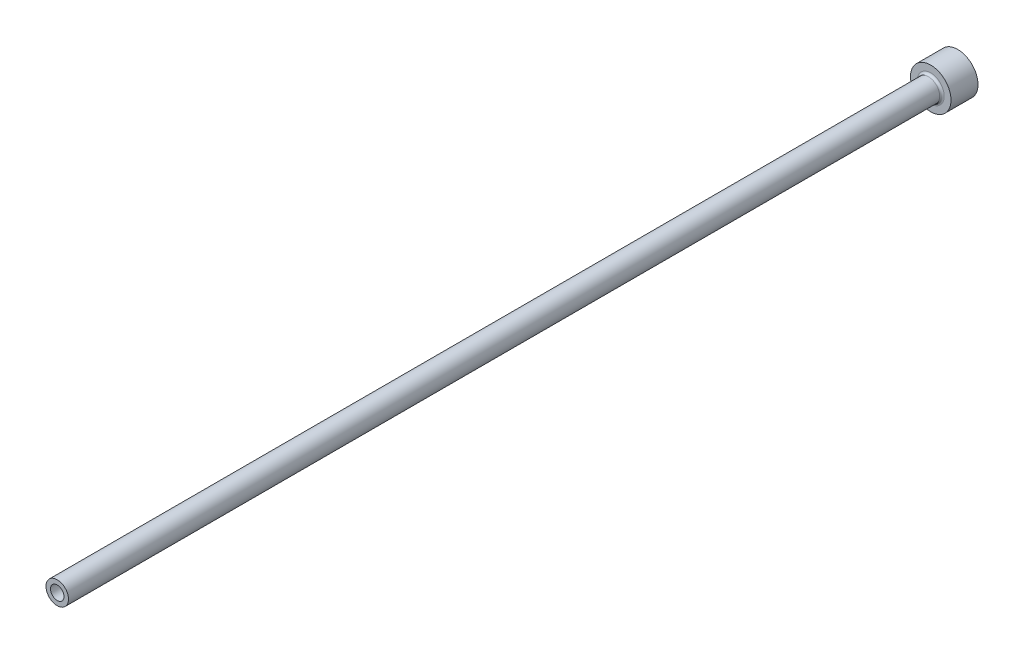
ISO-10303-21;
HEADER;
FILE_DESCRIPTION(('STEP AP214'),'2;1');
FILE_NAME('part.step','',(''),(''),'','','');
FILE_SCHEMA(('AUTOMOTIVE_DESIGN { 1 0 10303 214 1 1 1 1 }'));
ENDSEC;
DATA;
#1=APPLICATION_CONTEXT('core data for automotive mechanical design processes');
#2=APPLICATION_PROTOCOL_DEFINITION('international standard','automotive_design',2000,#1);
#3=PRODUCT_CONTEXT('',#1,'mechanical');
#4=PRODUCT('Part','Part','',(#3));
#5=PRODUCT_RELATED_PRODUCT_CATEGORY('part','',(#4));
#6=PRODUCT_DEFINITION_FORMATION('','',#4);
#7=PRODUCT_DEFINITION_CONTEXT('part definition',#1,'design');
#8=PRODUCT_DEFINITION('design','',#6,#7);
#9=PRODUCT_DEFINITION_SHAPE('','',#8);
#10=(LENGTH_UNIT() NAMED_UNIT(*) SI_UNIT(.MILLI.,.METRE.));
#11=(NAMED_UNIT(*) PLANE_ANGLE_UNIT() SI_UNIT($,.RADIAN.));
#12=(NAMED_UNIT(*) SI_UNIT($,.STERADIAN.) SOLID_ANGLE_UNIT());
#13=UNCERTAINTY_MEASURE_WITH_UNIT(LENGTH_MEASURE(1.E-05),#10,'distance_accuracy_value','');
#14=(GEOMETRIC_REPRESENTATION_CONTEXT(3) GLOBAL_UNCERTAINTY_ASSIGNED_CONTEXT((#13)) GLOBAL_UNIT_ASSIGNED_CONTEXT((#10,
#11,#12)) REPRESENTATION_CONTEXT('',''));
#15=CARTESIAN_POINT('',(0.,0.,0.));
#16=DIRECTION('',(0.,0.,1.));
#17=DIRECTION('',(1.,0.,0.));
#18=AXIS2_PLACEMENT_3D('',#15,#16,#17);
#19=CARTESIAN_POINT('',(0.,0.,200.));
#20=DIRECTION('',(0.,0.,-1.));
#21=DIRECTION('',(-1.,0.,0.));
#22=AXIS2_PLACEMENT_3D('',#19,#20,#21);
#23=PLANE('',#22);
#24=CARTESIAN_POINT('',(0.,0.,200.));
#25=DIRECTION('',(0.,0.,1.));
#26=DIRECTION('',(1.,0.,0.));
#27=AXIS2_PLACEMENT_3D('',#24,#25,#26);
#28=CIRCLE('',#27,1.49999999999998);
#29=CARTESIAN_POINT('',(1.49999999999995,0.,200.));
#30=VERTEX_POINT('',#29);
#31=EDGE_CURVE('E63',#30,#30,#28,.T.);
#32=ORIENTED_EDGE('',*,*,#31,.F.);
#33=EDGE_LOOP('',(#32));
#34=FACE_BOUND('',#33,.T.);
#35=CARTESIAN_POINT('',(0.,0.,200.));
#36=DIRECTION('',(0.,0.,1.));
#37=DIRECTION('',(1.,0.,0.));
#38=AXIS2_PLACEMENT_3D('',#35,#36,#37);
#39=CIRCLE('',#38,2.49999999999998);
#40=CARTESIAN_POINT('',(2.49999999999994,0.,200.));
#41=VERTEX_POINT('',#40);
#42=EDGE_CURVE('E54',#41,#41,#39,.T.);
#43=ORIENTED_EDGE('',*,*,#42,.T.);
#44=EDGE_LOOP('',(#43));
#45=FACE_BOUND('',#44,.T.);
#46=ADVANCED_FACE('F34',(#34,#45),#23,.F.);
#47=CARTESIAN_POINT('',(0.,0.,200.));
#48=DIRECTION('',(0.,0.,1.));
#49=DIRECTION('',(1.,0.,0.));
#50=AXIS2_PLACEMENT_3D('',#47,#48,#49);
#51=CYLINDRICAL_SURFACE('',#50,2.49999999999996);
#52=CARTESIAN_POINT('',(0.,0.,6.50000000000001));
#53=DIRECTION('',(0.,0.,1.));
#54=DIRECTION('',(1.,0.,0.));
#55=AXIS2_PLACEMENT_3D('',#52,#53,#54);
#56=CIRCLE('',#55,2.49999999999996);
#57=CARTESIAN_POINT('',(2.49999999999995,0.,6.50000000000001));
#58=VERTEX_POINT('',#57);
#59=EDGE_CURVE('E49',#58,#58,#56,.T.);
#60=ORIENTED_EDGE('',*,*,#59,.T.);
#61=EDGE_LOOP('',(#60));
#62=FACE_BOUND('',#61,.T.);
#63=ORIENTED_EDGE('',*,*,#42,.F.);
#64=EDGE_LOOP('',(#63));
#65=FACE_BOUND('',#64,.T.);
#66=ADVANCED_FACE('F92',(#62,#65),#51,.T.);
#67=CARTESIAN_POINT('',(0.,0.,6.));
#68=DIRECTION('',(0.,0.,1.));
#69=DIRECTION('',(1.,0.,0.));
#70=AXIS2_PLACEMENT_3D('',#67,#68,#69);
#71=PLANE('',#70);
#72=CARTESIAN_POINT('',(0.,0.,6.));
#73=DIRECTION('',(0.,0.,1.));
#74=DIRECTION('',(1.,0.,0.));
#75=AXIS2_PLACEMENT_3D('',#72,#73,#74);
#76=CIRCLE('',#75,2.99999999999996);
#77=CARTESIAN_POINT('',(2.99999999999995,0.,6.));
#78=VERTEX_POINT('',#77);
#79=EDGE_CURVE('E45',#78,#78,#76,.F.);
#80=ORIENTED_EDGE('',*,*,#79,.T.);
#81=EDGE_LOOP('',(#80));
#82=FACE_BOUND('',#81,.T.);
#83=CARTESIAN_POINT('',(0.,0.,6.00000000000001));
#84=DIRECTION('',(0.,0.,1.));
#85=DIRECTION('',(1.,0.,0.));
#86=AXIS2_PLACEMENT_3D('',#83,#84,#85);
#87=CIRCLE('',#86,4.49999999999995);
#88=CARTESIAN_POINT('',(4.49999999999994,0.,6.00000000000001));
#89=VERTEX_POINT('',#88);
#90=EDGE_CURVE('E57',#89,#89,#87,.T.);
#91=ORIENTED_EDGE('',*,*,#90,.T.);
#92=EDGE_LOOP('',(#91));
#93=FACE_BOUND('',#92,.T.);
#94=ADVANCED_FACE('F98',(#82,#93),#71,.T.);
#95=CARTESIAN_POINT('',(0.,0.,200.));
#96=DIRECTION('',(0.,0.,1.));
#97=DIRECTION('',(1.,0.,0.));
#98=AXIS2_PLACEMENT_3D('',#95,#96,#97);
#99=CYLINDRICAL_SURFACE('',#98,4.49999999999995);
#100=ORIENTED_EDGE('',*,*,#90,.F.);
#101=EDGE_LOOP('',(#100));
#102=FACE_BOUND('',#101,.T.);
#103=CARTESIAN_POINT('',(0.,0.,0.));
#104=DIRECTION('',(0.,0.,1.));
#105=DIRECTION('',(1.,0.,0.));
#106=AXIS2_PLACEMENT_3D('',#103,#104,#105);
#107=CIRCLE('',#106,4.49999999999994);
#108=CARTESIAN_POINT('',(4.49999999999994,0.,0.));
#109=VERTEX_POINT('',#108);
#110=EDGE_CURVE('E60',#109,#109,#107,.T.);
#111=ORIENTED_EDGE('',*,*,#110,.T.);
#112=EDGE_LOOP('',(#111));
#113=FACE_BOUND('',#112,.T.);
#114=ADVANCED_FACE('F89',(#102,#113),#99,.T.);
#115=CARTESIAN_POINT('',(0.,0.,0.));
#116=DIRECTION('',(0.,0.,1.));
#117=DIRECTION('',(1.,0.,0.));
#118=AXIS2_PLACEMENT_3D('',#115,#116,#117);
#119=PLANE('',#118);
#120=CARTESIAN_POINT('',(0.,0.,0.));
#121=DIRECTION('',(0.,0.,1.));
#122=DIRECTION('',(1.,0.,0.));
#123=AXIS2_PLACEMENT_3D('',#120,#121,#122);
#124=CIRCLE('',#123,2.24999999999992);
#125=CARTESIAN_POINT('',(2.24999999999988,0.,0.));
#126=VERTEX_POINT('',#125);
#127=EDGE_CURVE('E41',#126,#126,#124,.T.);
#128=ORIENTED_EDGE('',*,*,#127,.T.);
#129=EDGE_LOOP('',(#128));
#130=FACE_BOUND('',#129,.T.);
#131=ORIENTED_EDGE('',*,*,#110,.F.);
#132=EDGE_LOOP('',(#131));
#133=FACE_BOUND('',#132,.T.);
#134=ADVANCED_FACE('F83',(#130,#133),#119,.F.);
#135=CARTESIAN_POINT('',(0.,0.,200.));
#136=DIRECTION('',(0.,0.,1.));
#137=DIRECTION('',(1.,0.,0.));
#138=AXIS2_PLACEMENT_3D('',#135,#136,#137);
#139=CYLINDRICAL_SURFACE('',#138,1.49999999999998);
#140=ORIENTED_EDGE('',*,*,#31,.T.);
#141=EDGE_LOOP('',(#140));
#142=FACE_BOUND('',#141,.T.);
#143=CARTESIAN_POINT('',(0.,0.,125.));
#144=DIRECTION('',(0.,0.,1.));
#145=DIRECTION('',(1.,0.,0.));
#146=AXIS2_PLACEMENT_3D('',#143,#144,#145);
#147=CIRCLE('',#146,1.49999999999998);
#148=CARTESIAN_POINT('',(1.49999999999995,0.,125.));
#149=VERTEX_POINT('',#148);
#150=EDGE_CURVE('E66',#149,#149,#147,.T.);
#151=ORIENTED_EDGE('',*,*,#150,.F.);
#152=EDGE_LOOP('',(#151));
#153=FACE_BOUND('',#152,.T.);
#154=ADVANCED_FACE('F78',(#142,#153),#139,.F.);
#155=CARTESIAN_POINT('',(0.,0.,125.));
#156=DIRECTION('',(0.,0.,-1.));
#157=DIRECTION('',(-1.,0.,0.));
#158=AXIS2_PLACEMENT_3D('',#155,#156,#157);
#159=CONICAL_SURFACE('',#158,1.49999999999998,0.523598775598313);
#160=CARTESIAN_POINT('',(0.,0.,124.566987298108));
#161=DIRECTION('',(0.,0.,1.));
#162=DIRECTION('',(1.,0.,0.));
#163=AXIS2_PLACEMENT_3D('',#160,#161,#162);
#164=CIRCLE('',#163,1.74999999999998);
#165=CARTESIAN_POINT('',(1.74999999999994,0.,124.566987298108));
#166=VERTEX_POINT('',#165);
#167=EDGE_CURVE('E69',#166,#166,#164,.T.);
#168=ORIENTED_EDGE('',*,*,#167,.F.);
#169=EDGE_LOOP('',(#168));
#170=FACE_BOUND('',#169,.T.);
#171=ORIENTED_EDGE('',*,*,#150,.T.);
#172=EDGE_LOOP('',(#171));
#173=FACE_BOUND('',#172,.T.);
#174=ADVANCED_FACE('F75',(#170,#173),#159,.F.);
#175=CARTESIAN_POINT('',(0.,0.,200.));
#176=DIRECTION('',(0.,0.,1.));
#177=DIRECTION('',(1.,0.,0.));
#178=AXIS2_PLACEMENT_3D('',#175,#176,#177);
#179=CYLINDRICAL_SURFACE('',#178,1.74999999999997);
#180=CARTESIAN_POINT('',(0.,0.,0.499999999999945));
#181=DIRECTION('',(0.,0.,1.));
#182=DIRECTION('',(1.,0.,0.));
#183=AXIS2_PLACEMENT_3D('',#180,#181,#182);
#184=CIRCLE('',#183,1.74999999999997);
#185=CARTESIAN_POINT('',(1.74999999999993,0.,0.499999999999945));
#186=VERTEX_POINT('',#185);
#187=EDGE_CURVE('E10',#186,#186,#184,.F.);
#188=ORIENTED_EDGE('',*,*,#187,.T.);
#189=EDGE_LOOP('',(#188));
#190=FACE_BOUND('',#189,.T.);
#191=ORIENTED_EDGE('',*,*,#167,.T.);
#192=EDGE_LOOP('',(#191));
#193=FACE_BOUND('',#192,.T.);
#194=ADVANCED_FACE('F73',(#190,#193),#179,.F.);
#195=CARTESIAN_POINT('',(0.,0.,6.50000000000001));
#196=DIRECTION('',(0.,0.,1.));
#197=DIRECTION('',(1.,0.,0.));
#198=AXIS2_PLACEMENT_3D('',#195,#196,#197);
#199=TOROIDAL_SURFACE('',#198,2.99999999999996,0.5);
#200=ORIENTED_EDGE('',*,*,#79,.F.);
#201=EDGE_LOOP('',(#200));
#202=FACE_BOUND('',#201,.T.);
#203=ORIENTED_EDGE('',*,*,#59,.F.);
#204=EDGE_LOOP('',(#203));
#205=FACE_BOUND('',#204,.T.);
#206=ADVANCED_FACE('F104',(#202,#205),#199,.F.);
#207=CARTESIAN_POINT('',(0.,0.,0.));
#208=DIRECTION('',(0.,0.,-1.));
#209=DIRECTION('',(-1.,0.,0.));
#210=AXIS2_PLACEMENT_3D('',#207,#208,#209);
#211=CONICAL_SURFACE('',#210,2.24999999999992,0.785398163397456);
#212=ORIENTED_EDGE('',*,*,#187,.F.);
#213=EDGE_LOOP('',(#212));
#214=FACE_BOUND('',#213,.T.);
#215=ORIENTED_EDGE('',*,*,#127,.F.);
#216=EDGE_LOOP('',(#215));
#217=FACE_BOUND('',#216,.T.);
#218=ADVANCED_FACE('F36',(#214,#217),#211,.F.);
#219=CLOSED_SHELL('',(#46,#66,#94,#114,#134,#154,#174,#194,#206,#218));
#220=MANIFOLD_SOLID_BREP('B2',#219);
#221=ADVANCED_BREP_SHAPE_REPRESENTATION('',(#18,#220),#14);
#222=SHAPE_DEFINITION_REPRESENTATION(#9,#221);
ENDSEC;
END-ISO-10303-21;
